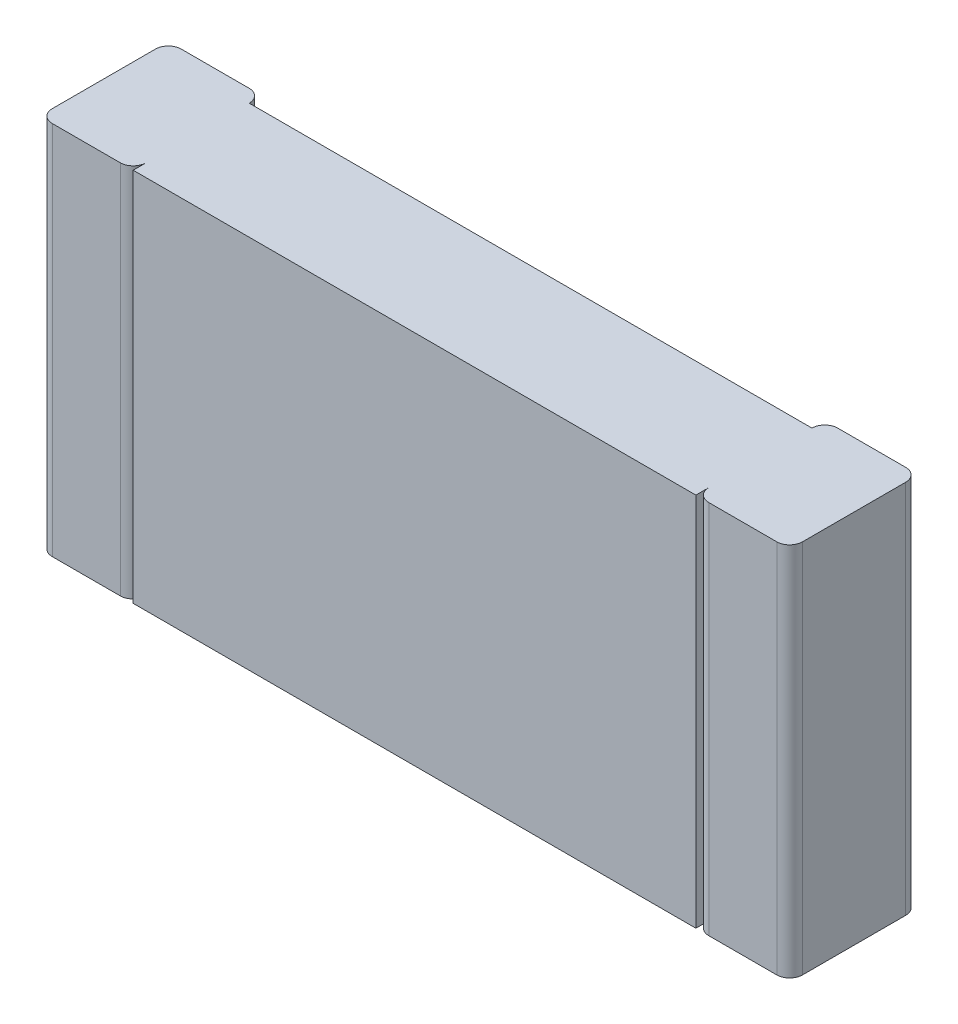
ISO-10303-21;
HEADER;
FILE_DESCRIPTION(('STEP AP214'),'2;1');
FILE_NAME('part.step','',(''),(''),'','','');
FILE_SCHEMA(('AUTOMOTIVE_DESIGN { 1 0 10303 214 1 1 1 1 }'));
ENDSEC;
DATA;
#1=APPLICATION_CONTEXT('core data for automotive mechanical design processes');
#2=APPLICATION_PROTOCOL_DEFINITION('international standard','automotive_design',2000,#1);
#3=PRODUCT_CONTEXT('',#1,'mechanical');
#4=PRODUCT('Part','Part','',(#3));
#5=PRODUCT_RELATED_PRODUCT_CATEGORY('part','',(#4));
#6=PRODUCT_DEFINITION_FORMATION('','',#4);
#7=PRODUCT_DEFINITION_CONTEXT('part definition',#1,'design');
#8=PRODUCT_DEFINITION('design','',#6,#7);
#9=PRODUCT_DEFINITION_SHAPE('','',#8);
#10=(LENGTH_UNIT() NAMED_UNIT(*) SI_UNIT(.MILLI.,.METRE.));
#11=(NAMED_UNIT(*) PLANE_ANGLE_UNIT() SI_UNIT($,.RADIAN.));
#12=(NAMED_UNIT(*) SI_UNIT($,.STERADIAN.) SOLID_ANGLE_UNIT());
#13=UNCERTAINTY_MEASURE_WITH_UNIT(LENGTH_MEASURE(1.E-05),#10,'distance_accuracy_value','');
#14=(GEOMETRIC_REPRESENTATION_CONTEXT(3) GLOBAL_UNCERTAINTY_ASSIGNED_CONTEXT((#13)) GLOBAL_UNIT_ASSIGNED_CONTEXT((#10,
#11,#12)) REPRESENTATION_CONTEXT('',''));
#15=CARTESIAN_POINT('',(0.,0.,0.));
#16=DIRECTION('',(0.,0.,1.));
#17=DIRECTION('',(1.,0.,0.));
#18=AXIS2_PLACEMENT_3D('',#15,#16,#17);
#19=CARTESIAN_POINT('',(-1.6,-0.8,0.55));
#20=DIRECTION('',(0.,0.,1.));
#21=DIRECTION('',(1.,0.,0.));
#22=AXIS2_PLACEMENT_3D('',#19,#20,#21);
#23=PLANE('',#22);
#24=DIRECTION('',(1.,0.,0.));
#25=VECTOR('',#24,1.);
#26=CARTESIAN_POINT('',(-1.6,-0.8,0.55));
#27=LINE('',#26,#25);
#28=CARTESIAN_POINT('',(-1.545,-0.8,0.55));
#29=VERTEX_POINT('',#28);
#30=CARTESIAN_POINT('',(-1.255,-0.8,0.55));
#31=VERTEX_POINT('',#30);
#32=EDGE_CURVE('E147',#29,#31,#27,.T.);
#33=ORIENTED_EDGE('',*,*,#32,.T.);
#34=DIRECTION('',(0.,1.,0.));
#35=VECTOR('',#34,1.);
#36=CARTESIAN_POINT('',(-1.255,-0.8,0.55));
#37=LINE('',#36,#35);
#38=CARTESIAN_POINT('',(-1.255,0.8,0.55));
#39=VERTEX_POINT('',#38);
#40=EDGE_CURVE('E172',#39,#31,#37,.F.);
#41=ORIENTED_EDGE('',*,*,#40,.F.);
#42=DIRECTION('',(1.,0.,0.));
#43=VECTOR('',#42,1.);
#44=CARTESIAN_POINT('',(-1.6,0.8,0.55));
#45=LINE('',#44,#43);
#46=CARTESIAN_POINT('',(-1.545,0.8,0.55));
#47=VERTEX_POINT('',#46);
#48=EDGE_CURVE('E178',#39,#47,#45,.F.);
#49=ORIENTED_EDGE('',*,*,#48,.T.);
#50=DIRECTION('',(0.,1.,0.));
#51=VECTOR('',#50,1.);
#52=CARTESIAN_POINT('',(-1.545,-0.8,0.55));
#53=LINE('',#52,#51);
#54=EDGE_CURVE('E151',#29,#47,#53,.T.);
#55=ORIENTED_EDGE('',*,*,#54,.F.);
#56=EDGE_LOOP('',(#33,#41,#49,#55));
#57=FACE_BOUND('',#56,.T.);
#58=ADVANCED_FACE('F17',(#57),#23,.T.);
#59=CARTESIAN_POINT('',(1.2,-0.8,0.55));
#60=DIRECTION('',(0.,0.,1.));
#61=DIRECTION('',(1.,0.,0.));
#62=AXIS2_PLACEMENT_3D('',#59,#60,#61);
#63=PLANE('',#62);
#64=DIRECTION('',(1.,0.,0.));
#65=VECTOR('',#64,1.);
#66=CARTESIAN_POINT('',(1.2,-0.8,0.55));
#67=LINE('',#66,#65);
#68=CARTESIAN_POINT('',(1.255,-0.8,0.55));
#69=VERTEX_POINT('',#68);
#70=CARTESIAN_POINT('',(1.545,-0.8,0.55));
#71=VERTEX_POINT('',#70);
#72=EDGE_CURVE('E152',#69,#71,#67,.T.);
#73=ORIENTED_EDGE('',*,*,#72,.T.);
#74=DIRECTION('',(0.,1.,0.));
#75=VECTOR('',#74,1.);
#76=CARTESIAN_POINT('',(1.545,-0.8,0.55));
#77=LINE('',#76,#75);
#78=CARTESIAN_POINT('',(1.545,0.8,0.55));
#79=VERTEX_POINT('',#78);
#80=EDGE_CURVE('E180',#79,#71,#77,.F.);
#81=ORIENTED_EDGE('',*,*,#80,.F.);
#82=DIRECTION('',(1.,0.,0.));
#83=VECTOR('',#82,1.);
#84=CARTESIAN_POINT('',(1.2,0.8,0.55));
#85=LINE('',#84,#83);
#86=CARTESIAN_POINT('',(1.255,0.8,0.55));
#87=VERTEX_POINT('',#86);
#88=EDGE_CURVE('E169',#79,#87,#85,.F.);
#89=ORIENTED_EDGE('',*,*,#88,.T.);
#90=DIRECTION('',(0.,1.,0.));
#91=VECTOR('',#90,1.);
#92=CARTESIAN_POINT('',(1.255,-0.8,0.55));
#93=LINE('',#92,#91);
#94=EDGE_CURVE('E165',#69,#87,#93,.T.);
#95=ORIENTED_EDGE('',*,*,#94,.F.);
#96=EDGE_LOOP('',(#73,#81,#89,#95));
#97=FACE_BOUND('',#96,.T.);
#98=ADVANCED_FACE('F226',(#97),#63,.T.);
#99=CARTESIAN_POINT('',(-1.545,-0.8,0.495));
#100=DIRECTION('',(0.,1.,0.));
#101=DIRECTION('',(0.,0.,1.));
#102=AXIS2_PLACEMENT_3D('',#99,#100,#101);
#103=CYLINDRICAL_SURFACE('',#102,0.055);
#104=CARTESIAN_POINT('',(-1.545,0.8,0.495));
#105=DIRECTION('',(0.,1.,0.));
#106=DIRECTION('',(0.,0.,1.));
#107=AXIS2_PLACEMENT_3D('',#104,#105,#106);
#108=CIRCLE('',#107,0.055);
#109=CARTESIAN_POINT('',(-1.6,0.8,0.495));
#110=VERTEX_POINT('',#109);
#111=EDGE_CURVE('E155',#47,#110,#108,.F.);
#112=ORIENTED_EDGE('',*,*,#111,.T.);
#113=DIRECTION('',(0.,1.,0.));
#114=VECTOR('',#113,1.);
#115=CARTESIAN_POINT('',(-1.6,-0.8,0.495));
#116=LINE('',#115,#114);
#117=CARTESIAN_POINT('',(-1.6,-0.8,0.495));
#118=VERTEX_POINT('',#117);
#119=EDGE_CURVE('E133',#110,#118,#116,.F.);
#120=ORIENTED_EDGE('',*,*,#119,.T.);
#121=CARTESIAN_POINT('',(-1.545,-0.8,0.495));
#122=DIRECTION('',(0.,1.,0.));
#123=DIRECTION('',(0.,0.,1.));
#124=AXIS2_PLACEMENT_3D('',#121,#122,#123);
#125=CIRCLE('',#124,0.055);
#126=EDGE_CURVE('E20',#118,#29,#125,.T.);
#127=ORIENTED_EDGE('',*,*,#126,.T.);
#128=ORIENTED_EDGE('',*,*,#54,.T.);
#129=EDGE_LOOP('',(#112,#120,#127,#128));
#130=FACE_BOUND('',#129,.T.);
#131=ADVANCED_FACE('F153',(#130),#103,.T.);
#132=CARTESIAN_POINT('',(1.545,-0.8,0.495));
#133=DIRECTION('',(0.,1.,0.));
#134=DIRECTION('',(0.,0.,1.));
#135=AXIS2_PLACEMENT_3D('',#132,#133,#134);
#136=CYLINDRICAL_SURFACE('',#135,0.055);
#137=ORIENTED_EDGE('',*,*,#80,.T.);
#138=CARTESIAN_POINT('',(1.545,-0.8,0.495));
#139=DIRECTION('',(0.,1.,0.));
#140=DIRECTION('',(0.,0.,1.));
#141=AXIS2_PLACEMENT_3D('',#138,#139,#140);
#142=CIRCLE('',#141,0.055);
#143=CARTESIAN_POINT('',(1.6,-0.8,0.495));
#144=VERTEX_POINT('',#143);
#145=EDGE_CURVE('E183',#71,#144,#142,.T.);
#146=ORIENTED_EDGE('',*,*,#145,.T.);
#147=DIRECTION('',(0.,1.,0.));
#148=VECTOR('',#147,1.);
#149=CARTESIAN_POINT('',(1.6,-0.8,0.495));
#150=LINE('',#149,#148);
#151=CARTESIAN_POINT('',(1.6,0.8,0.495));
#152=VERTEX_POINT('',#151);
#153=EDGE_CURVE('E163',#152,#144,#150,.F.);
#154=ORIENTED_EDGE('',*,*,#153,.F.);
#155=CARTESIAN_POINT('',(1.545,0.8,0.495));
#156=DIRECTION('',(0.,1.,0.));
#157=DIRECTION('',(0.,0.,1.));
#158=AXIS2_PLACEMENT_3D('',#155,#156,#157);
#159=CIRCLE('',#158,0.055);
#160=EDGE_CURVE('E184',#152,#79,#159,.F.);
#161=ORIENTED_EDGE('',*,*,#160,.T.);
#162=EDGE_LOOP('',(#137,#146,#154,#161));
#163=FACE_BOUND('',#162,.T.);
#164=ADVANCED_FACE('F216',(#163),#136,.T.);
#165=CARTESIAN_POINT('',(-1.255,-0.8,0.495));
#166=DIRECTION('',(0.,1.,0.));
#167=DIRECTION('',(0.,0.,1.));
#168=AXIS2_PLACEMENT_3D('',#165,#166,#167);
#169=CYLINDRICAL_SURFACE('',#168,0.055);
#170=ORIENTED_EDGE('',*,*,#40,.T.);
#171=CARTESIAN_POINT('',(-1.255,-0.8,0.495));
#172=DIRECTION('',(0.,1.,0.));
#173=DIRECTION('',(0.,0.,1.));
#174=AXIS2_PLACEMENT_3D('',#171,#172,#173);
#175=CIRCLE('',#174,0.055);
#176=CARTESIAN_POINT('',(-1.2,-0.8,0.495));
#177=VERTEX_POINT('',#176);
#178=EDGE_CURVE('E175',#31,#177,#175,.T.);
#179=ORIENTED_EDGE('',*,*,#178,.T.);
#180=DIRECTION('',(0.,1.,0.));
#181=VECTOR('',#180,1.);
#182=CARTESIAN_POINT('',(-1.2,-0.8,0.495));
#183=LINE('',#182,#181);
#184=CARTESIAN_POINT('',(-1.2,0.8,0.495));
#185=VERTEX_POINT('',#184);
#186=EDGE_CURVE('E239',#177,#185,#183,.T.);
#187=ORIENTED_EDGE('',*,*,#186,.T.);
#188=CARTESIAN_POINT('',(-1.255,0.8,0.495));
#189=DIRECTION('',(0.,1.,0.));
#190=DIRECTION('',(0.,0.,1.));
#191=AXIS2_PLACEMENT_3D('',#188,#189,#190);
#192=CIRCLE('',#191,0.055);
#193=EDGE_CURVE('E176',#185,#39,#192,.F.);
#194=ORIENTED_EDGE('',*,*,#193,.T.);
#195=EDGE_LOOP('',(#170,#179,#187,#194));
#196=FACE_BOUND('',#195,.T.);
#197=ADVANCED_FACE('F309',(#196),#169,.T.);
#198=CARTESIAN_POINT('',(1.255,-0.8,0.495));
#199=DIRECTION('',(0.,1.,0.));
#200=DIRECTION('',(0.,0.,1.));
#201=AXIS2_PLACEMENT_3D('',#198,#199,#200);
#202=CYLINDRICAL_SURFACE('',#201,0.055);
#203=CARTESIAN_POINT('',(1.255,0.8,0.495));
#204=DIRECTION('',(0.,1.,0.));
#205=DIRECTION('',(0.,0.,1.));
#206=AXIS2_PLACEMENT_3D('',#203,#204,#205);
#207=CIRCLE('',#206,0.055);
#208=CARTESIAN_POINT('',(1.2,0.8,0.495));
#209=VERTEX_POINT('',#208);
#210=EDGE_CURVE('E140',#87,#209,#207,.F.);
#211=ORIENTED_EDGE('',*,*,#210,.T.);
#212=DIRECTION('',(0.,1.,0.));
#213=VECTOR('',#212,1.);
#214=CARTESIAN_POINT('',(1.2,-0.8,0.495));
#215=LINE('',#214,#213);
#216=CARTESIAN_POINT('',(1.2,-0.8,0.495));
#217=VERTEX_POINT('',#216);
#218=EDGE_CURVE('E250',#217,#209,#215,.T.);
#219=ORIENTED_EDGE('',*,*,#218,.F.);
#220=CARTESIAN_POINT('',(1.255,-0.8,0.495));
#221=DIRECTION('',(0.,1.,0.));
#222=DIRECTION('',(0.,0.,1.));
#223=AXIS2_PLACEMENT_3D('',#220,#221,#222);
#224=CIRCLE('',#223,0.055);
#225=EDGE_CURVE('E168',#217,#69,#224,.T.);
#226=ORIENTED_EDGE('',*,*,#225,.T.);
#227=ORIENTED_EDGE('',*,*,#94,.T.);
#228=EDGE_LOOP('',(#211,#219,#226,#227));
#229=FACE_BOUND('',#228,.T.);
#230=ADVANCED_FACE('F470',(#229),#202,.T.);
#231=CARTESIAN_POINT('',(-1.6,-0.8,0.));
#232=DIRECTION('',(1.,0.,0.));
#233=DIRECTION('',(0.,0.,-1.));
#234=AXIS2_PLACEMENT_3D('',#231,#232,#233);
#235=PLANE('',#234);
#236=DIRECTION('',(0.,0.,-1.));
#237=VECTOR('',#236,1.);
#238=CARTESIAN_POINT('',(-1.6,0.8,0.));
#239=LINE('',#238,#237);
#240=CARTESIAN_POINT('',(-1.6,0.8,0.055));
#241=VERTEX_POINT('',#240);
#242=EDGE_CURVE('E139',#241,#110,#239,.F.);
#243=ORIENTED_EDGE('',*,*,#242,.F.);
#244=DIRECTION('',(0.,1.,0.));
#245=VECTOR('',#244,1.);
#246=CARTESIAN_POINT('',(-1.6,-0.8,0.055));
#247=LINE('',#246,#245);
#248=CARTESIAN_POINT('',(-1.6,-0.8,0.055));
#249=VERTEX_POINT('',#248);
#250=EDGE_CURVE('E136',#249,#241,#247,.T.);
#251=ORIENTED_EDGE('',*,*,#250,.F.);
#252=DIRECTION('',(0.,0.,-1.));
#253=VECTOR('',#252,1.);
#254=CARTESIAN_POINT('',(-1.6,-0.8,0.));
#255=LINE('',#254,#253);
#256=EDGE_CURVE('E129',#118,#249,#255,.T.);
#257=ORIENTED_EDGE('',*,*,#256,.F.);
#258=ORIENTED_EDGE('',*,*,#119,.F.);
#259=EDGE_LOOP('',(#243,#251,#257,#258));
#260=FACE_BOUND('',#259,.T.);
#261=ADVANCED_FACE('F131',(#260),#235,.F.);
#262=CARTESIAN_POINT('',(1.6,-0.8,0.));
#263=DIRECTION('',(1.,0.,0.));
#264=DIRECTION('',(0.,0.,-1.));
#265=AXIS2_PLACEMENT_3D('',#262,#263,#264);
#266=PLANE('',#265);
#267=DIRECTION('',(0.,0.,-1.));
#268=VECTOR('',#267,1.);
#269=CARTESIAN_POINT('',(1.6,0.8,0.));
#270=LINE('',#269,#268);
#271=CARTESIAN_POINT('',(1.6,0.8,0.055));
#272=VERTEX_POINT('',#271);
#273=EDGE_CURVE('E158',#272,#152,#270,.F.);
#274=ORIENTED_EDGE('',*,*,#273,.T.);
#275=ORIENTED_EDGE('',*,*,#153,.T.);
#276=DIRECTION('',(0.,0.,-1.));
#277=VECTOR('',#276,1.);
#278=CARTESIAN_POINT('',(1.6,-0.8,0.));
#279=LINE('',#278,#277);
#280=CARTESIAN_POINT('',(1.6,-0.8,0.055));
#281=VERTEX_POINT('',#280);
#282=EDGE_CURVE('E156',#144,#281,#279,.T.);
#283=ORIENTED_EDGE('',*,*,#282,.T.);
#284=DIRECTION('',(0.,1.,0.));
#285=VECTOR('',#284,1.);
#286=CARTESIAN_POINT('',(1.6,-0.8,0.055));
#287=LINE('',#286,#285);
#288=EDGE_CURVE('E200',#272,#281,#287,.F.);
#289=ORIENTED_EDGE('',*,*,#288,.F.);
#290=EDGE_LOOP('',(#274,#275,#283,#289));
#291=FACE_BOUND('',#290,.T.);
#292=ADVANCED_FACE('F234',(#291),#266,.T.);
#293=CARTESIAN_POINT('',(-1.2,-0.8,0.495));
#294=DIRECTION('',(1.,0.,0.));
#295=DIRECTION('',(0.,0.,-1.));
#296=AXIS2_PLACEMENT_3D('',#293,#294,#295);
#297=PLANE('',#296);
#298=DIRECTION('',(0.,0.,-1.));
#299=VECTOR('',#298,1.);
#300=CARTESIAN_POINT('',(-1.2,0.8,0.495));
#301=LINE('',#300,#299);
#302=CARTESIAN_POINT('',(-1.2,0.8,0.55));
#303=VERTEX_POINT('',#302);
#304=EDGE_CURVE('E270',#185,#303,#301,.F.);
#305=ORIENTED_EDGE('',*,*,#304,.F.);
#306=ORIENTED_EDGE('',*,*,#186,.F.);
#307=DIRECTION('',(0.,0.,-1.));
#308=VECTOR('',#307,1.);
#309=CARTESIAN_POINT('',(-1.2,-0.8,0.495));
#310=LINE('',#309,#308);
#311=CARTESIAN_POINT('',(-1.2,-0.8,0.55));
#312=VERTEX_POINT('',#311);
#313=EDGE_CURVE('E237',#312,#177,#310,.T.);
#314=ORIENTED_EDGE('',*,*,#313,.F.);
#315=DIRECTION('',(0.,1.,0.));
#316=VECTOR('',#315,1.);
#317=CARTESIAN_POINT('',(-1.2,-0.8,0.55));
#318=LINE('',#317,#316);
#319=EDGE_CURVE('E246',#303,#312,#318,.F.);
#320=ORIENTED_EDGE('',*,*,#319,.F.);
#321=EDGE_LOOP('',(#305,#306,#314,#320));
#322=FACE_BOUND('',#321,.T.);
#323=ADVANCED_FACE('F307',(#322),#297,.F.);
#324=CARTESIAN_POINT('',(1.2,-0.8,0.495));
#325=DIRECTION('',(1.,0.,0.));
#326=DIRECTION('',(0.,0.,-1.));
#327=AXIS2_PLACEMENT_3D('',#324,#325,#326);
#328=PLANE('',#327);
#329=DIRECTION('',(0.,0.,-1.));
#330=VECTOR('',#329,1.);
#331=CARTESIAN_POINT('',(1.2,0.8,0.495));
#332=LINE('',#331,#330);
#333=CARTESIAN_POINT('',(1.2,0.8,0.55));
#334=VERTEX_POINT('',#333);
#335=EDGE_CURVE('E248',#209,#334,#332,.F.);
#336=ORIENTED_EDGE('',*,*,#335,.T.);
#337=DIRECTION('',(0.,1.,0.));
#338=VECTOR('',#337,1.);
#339=CARTESIAN_POINT('',(1.2,-0.8,0.55));
#340=LINE('',#339,#338);
#341=CARTESIAN_POINT('',(1.2,-0.8,0.55));
#342=VERTEX_POINT('',#341);
#343=EDGE_CURVE('E258',#342,#334,#340,.T.);
#344=ORIENTED_EDGE('',*,*,#343,.F.);
#345=DIRECTION('',(0.,0.,-1.));
#346=VECTOR('',#345,1.);
#347=CARTESIAN_POINT('',(1.2,-0.8,0.495));
#348=LINE('',#347,#346);
#349=EDGE_CURVE('E253',#342,#217,#348,.T.);
#350=ORIENTED_EDGE('',*,*,#349,.T.);
#351=ORIENTED_EDGE('',*,*,#218,.T.);
#352=EDGE_LOOP('',(#336,#344,#350,#351));
#353=FACE_BOUND('',#352,.T.);
#354=ADVANCED_FACE('F302',(#353),#328,.T.);
#355=CARTESIAN_POINT('',(-1.545,-0.8,0.055));
#356=DIRECTION('',(0.,1.,0.));
#357=DIRECTION('',(0.,0.,1.));
#358=AXIS2_PLACEMENT_3D('',#355,#356,#357);
#359=CYLINDRICAL_SURFACE('',#358,0.055);
#360=DIRECTION('',(0.,1.,0.));
#361=VECTOR('',#360,1.);
#362=CARTESIAN_POINT('',(-1.545,-0.8,0.));
#363=LINE('',#362,#361);
#364=CARTESIAN_POINT('',(-1.545,0.8,0.));
#365=VERTEX_POINT('',#364);
#366=CARTESIAN_POINT('',(-1.545,-0.8,0.));
#367=VERTEX_POINT('',#366);
#368=EDGE_CURVE('E244',#365,#367,#363,.F.);
#369=ORIENTED_EDGE('',*,*,#368,.T.);
#370=CARTESIAN_POINT('',(-1.545,-0.8,0.055));
#371=DIRECTION('',(0.,1.,0.));
#372=DIRECTION('',(0.,0.,1.));
#373=AXIS2_PLACEMENT_3D('',#370,#371,#372);
#374=CIRCLE('',#373,0.055);
#375=EDGE_CURVE('E203',#367,#249,#374,.T.);
#376=ORIENTED_EDGE('',*,*,#375,.T.);
#377=ORIENTED_EDGE('',*,*,#250,.T.);
#378=CARTESIAN_POINT('',(-1.545,0.8,0.055));
#379=DIRECTION('',(0.,1.,0.));
#380=DIRECTION('',(0.,0.,1.));
#381=AXIS2_PLACEMENT_3D('',#378,#379,#380);
#382=CIRCLE('',#381,0.055);
#383=EDGE_CURVE('E205',#241,#365,#382,.F.);
#384=ORIENTED_EDGE('',*,*,#383,.T.);
#385=EDGE_LOOP('',(#369,#376,#377,#384));
#386=FACE_BOUND('',#385,.T.);
#387=ADVANCED_FACE('F316',(#386),#359,.T.);
#388=CARTESIAN_POINT('',(1.545,-0.8,0.055));
#389=DIRECTION('',(0.,1.,0.));
#390=DIRECTION('',(0.,0.,1.));
#391=AXIS2_PLACEMENT_3D('',#388,#389,#390);
#392=CYLINDRICAL_SURFACE('',#391,0.055);
#393=CARTESIAN_POINT('',(1.545,0.8,0.055));
#394=DIRECTION('',(0.,1.,0.));
#395=DIRECTION('',(0.,0.,1.));
#396=AXIS2_PLACEMENT_3D('',#393,#394,#395);
#397=CIRCLE('',#396,0.055);
#398=CARTESIAN_POINT('',(1.545,0.8,0.));
#399=VERTEX_POINT('',#398);
#400=EDGE_CURVE('E198',#399,#272,#397,.F.);
#401=ORIENTED_EDGE('',*,*,#400,.T.);
#402=ORIENTED_EDGE('',*,*,#288,.T.);
#403=CARTESIAN_POINT('',(1.545,-0.8,0.055));
#404=DIRECTION('',(0.,1.,0.));
#405=DIRECTION('',(0.,0.,1.));
#406=AXIS2_PLACEMENT_3D('',#403,#404,#405);
#407=CIRCLE('',#406,0.055);
#408=CARTESIAN_POINT('',(1.545,-0.8,0.));
#409=VERTEX_POINT('',#408);
#410=EDGE_CURVE('E201',#281,#409,#407,.T.);
#411=ORIENTED_EDGE('',*,*,#410,.T.);
#412=DIRECTION('',(0.,1.,0.));
#413=VECTOR('',#412,1.);
#414=CARTESIAN_POINT('',(1.545,-0.8,0.));
#415=LINE('',#414,#413);
#416=EDGE_CURVE('E276',#409,#399,#415,.T.);
#417=ORIENTED_EDGE('',*,*,#416,.T.);
#418=EDGE_LOOP('',(#401,#402,#411,#417));
#419=FACE_BOUND('',#418,.T.);
#420=ADVANCED_FACE('F435',(#419),#392,.T.);
#421=CARTESIAN_POINT('',(-1.2,-0.8,0.55));
#422=DIRECTION('',(0.,0.,1.));
#423=DIRECTION('',(1.,0.,0.));
#424=AXIS2_PLACEMENT_3D('',#421,#422,#423);
#425=PLANE('',#424);
#426=ORIENTED_EDGE('',*,*,#343,.T.);
#427=DIRECTION('',(1.,0.,0.));
#428=VECTOR('',#427,1.);
#429=CARTESIAN_POINT('',(-1.2,0.8,0.55));
#430=LINE('',#429,#428);
#431=EDGE_CURVE('E263',#303,#334,#430,.T.);
#432=ORIENTED_EDGE('',*,*,#431,.F.);
#433=ORIENTED_EDGE('',*,*,#319,.T.);
#434=DIRECTION('',(1.,0.,0.));
#435=VECTOR('',#434,1.);
#436=CARTESIAN_POINT('',(-1.2,-0.8,0.55));
#437=LINE('',#436,#435);
#438=EDGE_CURVE('E273',#312,#342,#437,.T.);
#439=ORIENTED_EDGE('',*,*,#438,.T.);
#440=EDGE_LOOP('',(#426,#432,#433,#439));
#441=FACE_BOUND('',#440,.T.);
#442=ADVANCED_FACE('F294',(#441),#425,.T.);
#443=CARTESIAN_POINT('',(-1.6,-0.8,0.));
#444=DIRECTION('',(0.,0.,1.));
#445=DIRECTION('',(1.,0.,0.));
#446=AXIS2_PLACEMENT_3D('',#443,#444,#445);
#447=PLANE('',#446);
#448=DIRECTION('',(1.,0.,0.));
#449=VECTOR('',#448,1.);
#450=CARTESIAN_POINT('',(-1.6,-0.8,0.));
#451=LINE('',#450,#449);
#452=CARTESIAN_POINT('',(-1.255,-0.8,0.));
#453=VERTEX_POINT('',#452);
#454=EDGE_CURVE('E277',#453,#367,#451,.F.);
#455=ORIENTED_EDGE('',*,*,#454,.T.);
#456=ORIENTED_EDGE('',*,*,#368,.F.);
#457=DIRECTION('',(1.,0.,0.));
#458=VECTOR('',#457,1.);
#459=CARTESIAN_POINT('',(-1.6,0.8,0.));
#460=LINE('',#459,#458);
#461=CARTESIAN_POINT('',(-1.255,0.8,0.));
#462=VERTEX_POINT('',#461);
#463=EDGE_CURVE('E266',#462,#365,#460,.F.);
#464=ORIENTED_EDGE('',*,*,#463,.F.);
#465=DIRECTION('',(0.,1.,0.));
#466=VECTOR('',#465,1.);
#467=CARTESIAN_POINT('',(-1.255,-0.8,0.));
#468=LINE('',#467,#466);
#469=EDGE_CURVE('E193',#453,#462,#468,.T.);
#470=ORIENTED_EDGE('',*,*,#469,.F.);
#471=EDGE_LOOP('',(#455,#456,#464,#470));
#472=FACE_BOUND('',#471,.T.);
#473=ADVANCED_FACE('F328',(#472),#447,.F.);
#474=CARTESIAN_POINT('',(1.2,-0.8,0.));
#475=DIRECTION('',(0.,0.,1.));
#476=DIRECTION('',(1.,0.,0.));
#477=AXIS2_PLACEMENT_3D('',#474,#475,#476);
#478=PLANE('',#477);
#479=DIRECTION('',(1.,0.,0.));
#480=VECTOR('',#479,1.);
#481=CARTESIAN_POINT('',(1.2,-0.8,0.));
#482=LINE('',#481,#480);
#483=CARTESIAN_POINT('',(1.255,-0.8,0.));
#484=VERTEX_POINT('',#483);
#485=EDGE_CURVE('E333',#409,#484,#482,.F.);
#486=ORIENTED_EDGE('',*,*,#485,.T.);
#487=DIRECTION('',(0.,1.,0.));
#488=VECTOR('',#487,1.);
#489=CARTESIAN_POINT('',(1.255,-0.8,0.));
#490=LINE('',#489,#488);
#491=CARTESIAN_POINT('',(1.255,0.8,0.));
#492=VERTEX_POINT('',#491);
#493=EDGE_CURVE('E189',#492,#484,#490,.F.);
#494=ORIENTED_EDGE('',*,*,#493,.F.);
#495=DIRECTION('',(1.,0.,0.));
#496=VECTOR('',#495,1.);
#497=CARTESIAN_POINT('',(1.2,0.8,0.));
#498=LINE('',#497,#496);
#499=EDGE_CURVE('E197',#399,#492,#498,.F.);
#500=ORIENTED_EDGE('',*,*,#499,.F.);
#501=ORIENTED_EDGE('',*,*,#416,.F.);
#502=EDGE_LOOP('',(#486,#494,#500,#501));
#503=FACE_BOUND('',#502,.T.);
#504=ADVANCED_FACE('F354',(#503),#478,.F.);
#505=CARTESIAN_POINT('',(-1.255,-0.8,0.055));
#506=DIRECTION('',(0.,1.,0.));
#507=DIRECTION('',(0.,0.,1.));
#508=AXIS2_PLACEMENT_3D('',#505,#506,#507);
#509=CYLINDRICAL_SURFACE('',#508,0.055);
#510=CARTESIAN_POINT('',(-1.255,0.8,0.055));
#511=DIRECTION('',(0.,1.,0.));
#512=DIRECTION('',(0.,0.,1.));
#513=AXIS2_PLACEMENT_3D('',#510,#511,#512);
#514=CIRCLE('',#513,0.055);
#515=CARTESIAN_POINT('',(-1.2,0.8,0.055));
#516=VERTEX_POINT('',#515);
#517=EDGE_CURVE('E191',#462,#516,#514,.F.);
#518=ORIENTED_EDGE('',*,*,#517,.T.);
#519=DIRECTION('',(0.,1.,0.));
#520=VECTOR('',#519,1.);
#521=CARTESIAN_POINT('',(-1.2,-0.8,0.055));
#522=LINE('',#521,#520);
#523=CARTESIAN_POINT('',(-1.2,-0.8,0.055));
#524=VERTEX_POINT('',#523);
#525=EDGE_CURVE('E188',#516,#524,#522,.F.);
#526=ORIENTED_EDGE('',*,*,#525,.T.);
#527=CARTESIAN_POINT('',(-1.255,-0.8,0.055));
#528=DIRECTION('',(0.,1.,0.));
#529=DIRECTION('',(0.,0.,1.));
#530=AXIS2_PLACEMENT_3D('',#527,#528,#529);
#531=CIRCLE('',#530,0.055);
#532=EDGE_CURVE('E194',#524,#453,#531,.T.);
#533=ORIENTED_EDGE('',*,*,#532,.T.);
#534=ORIENTED_EDGE('',*,*,#469,.T.);
#535=EDGE_LOOP('',(#518,#526,#533,#534));
#536=FACE_BOUND('',#535,.T.);
#537=ADVANCED_FACE('F325',(#536),#509,.T.);
#538=CARTESIAN_POINT('',(-1.545,-0.8,0.055));
#539=DIRECTION('',(0.,1.,0.));
#540=DIRECTION('',(0.,0.,1.));
#541=AXIS2_PLACEMENT_3D('',#538,#539,#540);
#542=PLANE('',#541);
#543=DIRECTION('',(1.,0.,0.));
#544=VECTOR('',#543,1.);
#545=CARTESIAN_POINT('',(-1.545,-0.8,0.055));
#546=LINE('',#545,#544);
#547=CARTESIAN_POINT('',(1.2,-0.8,0.055));
#548=VERTEX_POINT('',#547);
#549=EDGE_CURVE('E347',#524,#548,#546,.T.);
#550=ORIENTED_EDGE('',*,*,#549,.T.);
#551=CARTESIAN_POINT('',(1.255,-0.8,0.055));
#552=DIRECTION('',(0.,1.,0.));
#553=DIRECTION('',(0.,0.,1.));
#554=AXIS2_PLACEMENT_3D('',#551,#552,#553);
#555=CIRCLE('',#554,0.055);
#556=EDGE_CURVE('E186',#484,#548,#555,.T.);
#557=ORIENTED_EDGE('',*,*,#556,.F.);
#558=ORIENTED_EDGE('',*,*,#485,.F.);
#559=ORIENTED_EDGE('',*,*,#410,.F.);
#560=ORIENTED_EDGE('',*,*,#282,.F.);
#561=ORIENTED_EDGE('',*,*,#145,.F.);
#562=ORIENTED_EDGE('',*,*,#72,.F.);
#563=ORIENTED_EDGE('',*,*,#225,.F.);
#564=ORIENTED_EDGE('',*,*,#349,.F.);
#565=ORIENTED_EDGE('',*,*,#438,.F.);
#566=ORIENTED_EDGE('',*,*,#313,.T.);
#567=ORIENTED_EDGE('',*,*,#178,.F.);
#568=ORIENTED_EDGE('',*,*,#32,.F.);
#569=ORIENTED_EDGE('',*,*,#126,.F.);
#570=ORIENTED_EDGE('',*,*,#256,.T.);
#571=ORIENTED_EDGE('',*,*,#375,.F.);
#572=ORIENTED_EDGE('',*,*,#454,.F.);
#573=ORIENTED_EDGE('',*,*,#532,.F.);
#574=EDGE_LOOP('',(#550,#557,#558,#559,#560,#561,#562,#563,#564,#565,#566,#567,#568,#569,#570,
#571,#572,#573));
#575=FACE_BOUND('',#574,.T.);
#576=ADVANCED_FACE('F145',(#575),#542,.F.);
#577=CARTESIAN_POINT('',(1.255,-0.8,0.055));
#578=DIRECTION('',(0.,1.,0.));
#579=DIRECTION('',(0.,0.,1.));
#580=AXIS2_PLACEMENT_3D('',#577,#578,#579);
#581=CYLINDRICAL_SURFACE('',#580,0.055);
#582=ORIENTED_EDGE('',*,*,#493,.T.);
#583=ORIENTED_EDGE('',*,*,#556,.T.);
#584=DIRECTION('',(0.,1.,0.));
#585=VECTOR('',#584,1.);
#586=CARTESIAN_POINT('',(1.2,-0.8,0.055));
#587=LINE('',#586,#585);
#588=CARTESIAN_POINT('',(1.2,0.8,0.055));
#589=VERTEX_POINT('',#588);
#590=EDGE_CURVE('E26',#548,#589,#587,.T.);
#591=ORIENTED_EDGE('',*,*,#590,.T.);
#592=CARTESIAN_POINT('',(1.255,0.8,0.055));
#593=DIRECTION('',(0.,1.,0.));
#594=DIRECTION('',(0.,0.,1.));
#595=AXIS2_PLACEMENT_3D('',#592,#593,#594);
#596=CIRCLE('',#595,0.055);
#597=EDGE_CURVE('E34',#589,#492,#596,.F.);
#598=ORIENTED_EDGE('',*,*,#597,.T.);
#599=EDGE_LOOP('',(#582,#583,#591,#598));
#600=FACE_BOUND('',#599,.T.);
#601=ADVANCED_FACE('F353',(#600),#581,.T.);
#602=CARTESIAN_POINT('',(-1.545,0.8,0.055));
#603=DIRECTION('',(0.,1.,0.));
#604=DIRECTION('',(0.,0.,1.));
#605=AXIS2_PLACEMENT_3D('',#602,#603,#604);
#606=PLANE('',#605);
#607=DIRECTION('',(1.,0.,0.));
#608=VECTOR('',#607,1.);
#609=CARTESIAN_POINT('',(-1.545,0.8,0.055));
#610=LINE('',#609,#608);
#611=EDGE_CURVE('E11',#589,#516,#610,.F.);
#612=ORIENTED_EDGE('',*,*,#611,.T.);
#613=ORIENTED_EDGE('',*,*,#517,.F.);
#614=ORIENTED_EDGE('',*,*,#463,.T.);
#615=ORIENTED_EDGE('',*,*,#383,.F.);
#616=ORIENTED_EDGE('',*,*,#242,.T.);
#617=ORIENTED_EDGE('',*,*,#111,.F.);
#618=ORIENTED_EDGE('',*,*,#48,.F.);
#619=ORIENTED_EDGE('',*,*,#193,.F.);
#620=ORIENTED_EDGE('',*,*,#304,.T.);
#621=ORIENTED_EDGE('',*,*,#431,.T.);
#622=ORIENTED_EDGE('',*,*,#335,.F.);
#623=ORIENTED_EDGE('',*,*,#210,.F.);
#624=ORIENTED_EDGE('',*,*,#88,.F.);
#625=ORIENTED_EDGE('',*,*,#160,.F.);
#626=ORIENTED_EDGE('',*,*,#273,.F.);
#627=ORIENTED_EDGE('',*,*,#400,.F.);
#628=ORIENTED_EDGE('',*,*,#499,.T.);
#629=ORIENTED_EDGE('',*,*,#597,.F.);
#630=EDGE_LOOP('',(#612,#613,#614,#615,#616,#617,#618,#619,#620,#621,#622,#623,#624,#625,#626,
#627,#628,#629));
#631=FACE_BOUND('',#630,.T.);
#632=ADVANCED_FACE('F222',(#631),#606,.T.);
#633=CARTESIAN_POINT('',(-1.545,-0.8,0.055));
#634=DIRECTION('',(0.,0.,1.));
#635=DIRECTION('',(1.,0.,0.));
#636=AXIS2_PLACEMENT_3D('',#633,#634,#635);
#637=PLANE('',#636);
#638=ORIENTED_EDGE('',*,*,#590,.F.);
#639=ORIENTED_EDGE('',*,*,#549,.F.);
#640=ORIENTED_EDGE('',*,*,#525,.F.);
#641=ORIENTED_EDGE('',*,*,#611,.F.);
#642=EDGE_LOOP('',(#638,#639,#640,#641));
#643=FACE_BOUND('',#642,.T.);
#644=ADVANCED_FACE('F364',(#643),#637,.F.);
#645=CLOSED_SHELL('',(#58,#98,#131,#164,#197,#230,#261,#292,#323,#354,#387,#420,#442,#473,#504,
#537,#576,#601,#632,#644));
#646=MANIFOLD_SOLID_BREP('B1',#645);
#647=ADVANCED_BREP_SHAPE_REPRESENTATION('',(#18,#646),#14);
#648=SHAPE_DEFINITION_REPRESENTATION(#9,#647);
ENDSEC;
END-ISO-10303-21;
